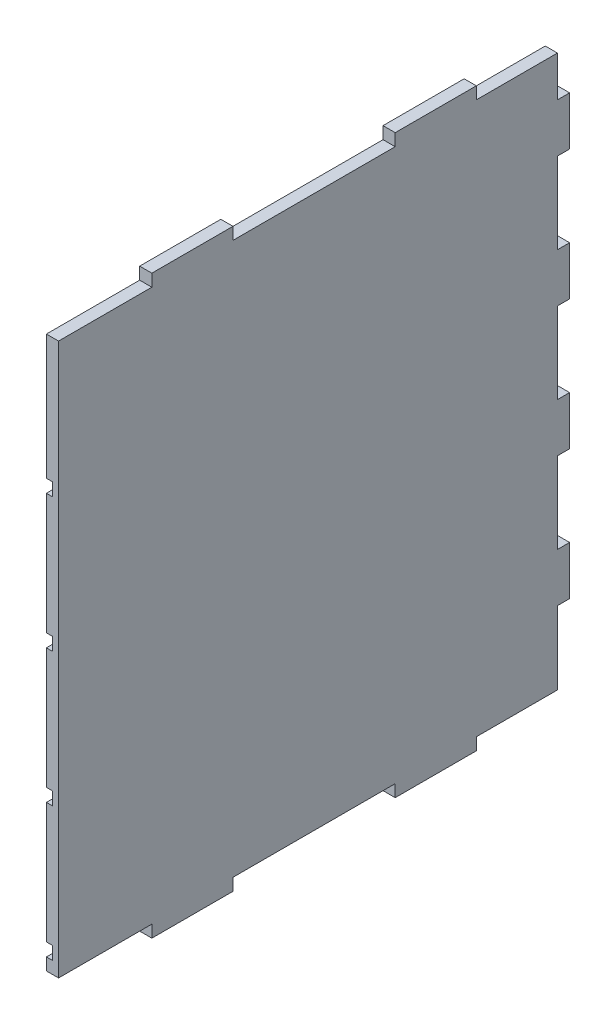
from build123d import *

# Parameters (mm, degrees)
SALIENTE_EXTRUIR1_DEPTH = 630
CROQUIS2_W              = 115
CROQUIS2_H              = 15
CROQUIS2_W_2            = 200
CORTAR_EXTRUIR1_DEPTH   = 950.328710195
CROQUIS3_W              = 15
CROQUIS3_H              = 100
CORTAR_EXTRUIR3_DEPTH   = 950.328710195


with BuildPart() as part:
    # Croquis1 → Saliente-Extruir1 (new body)
    with BuildSketch(Plane.XY):
        Polygon((0, 0), (-15, 0), (-15, 30), (-7.5, 30), (-7.5, 46), (-15, 46), (-15, 195), (-7.5, 195), (-7.5, 211), (-15, 211), (-15, 360), (-7.5, 360), (-7.5, 376), (-15, 376), (-15, 525), (-7.5, 525), (-7.5, 541), (-15, 541), (-15, 710), (0, 710), align=None)
    extrude(amount=SALIENTE_EXTRUIR1_DEPTH)

    # Croquis2 → Cortar-Extruir1 (cut, through all)
    with BuildSketch(Plane(origin=(0, 0, 0), x_dir=(0, 0, -1), z_dir=(1, 0, 0))):
        with Locations((-57.5, 7.5)):
            Rectangle(CROQUIS2_W, CROQUIS2_H)
        with Locations((-315, 7.5)):
            Rectangle(CROQUIS2_W_2, CROQUIS2_H)
        with Locations((-572.5, 7.5)):
            Rectangle(CROQUIS2_W, CROQUIS2_H)
        with Locations((-572.5, 702.5)):
            Rectangle(CROQUIS2_W, CROQUIS2_H)
        with Locations((-315, 702.5)):
            Rectangle(CROQUIS2_W_2, CROQUIS2_H)
        with Locations((-57.5, 702.5)):
            Rectangle(CROQUIS2_W, CROQUIS2_H)
    extrude(amount=-CORTAR_EXTRUIR1_DEPTH, mode=Mode.SUBTRACT)

    # Croquis3 → Cortar-Extruir3 (cut, through all)
    with BuildSketch(Plane.ZY.offset(15)):
        with Locations((7.5, 55)):
            Rectangle(CROQUIS3_W, CROQUIS3_H)
        with Locations((7.5, 215)):
            Rectangle(CROQUIS3_W, CROQUIS3_H)
        with Locations((7.5, 375)):
            Rectangle(CROQUIS3_W, CROQUIS3_H)
        with Locations((7.5, 535)):
            Rectangle(CROQUIS3_W, CROQUIS3_H)
        with Locations((7.5, 695)):
            Rectangle(CROQUIS3_W, CROQUIS3_H)
    extrude(amount=-CORTAR_EXTRUIR3_DEPTH, mode=Mode.SUBTRACT)


solid = part.part
